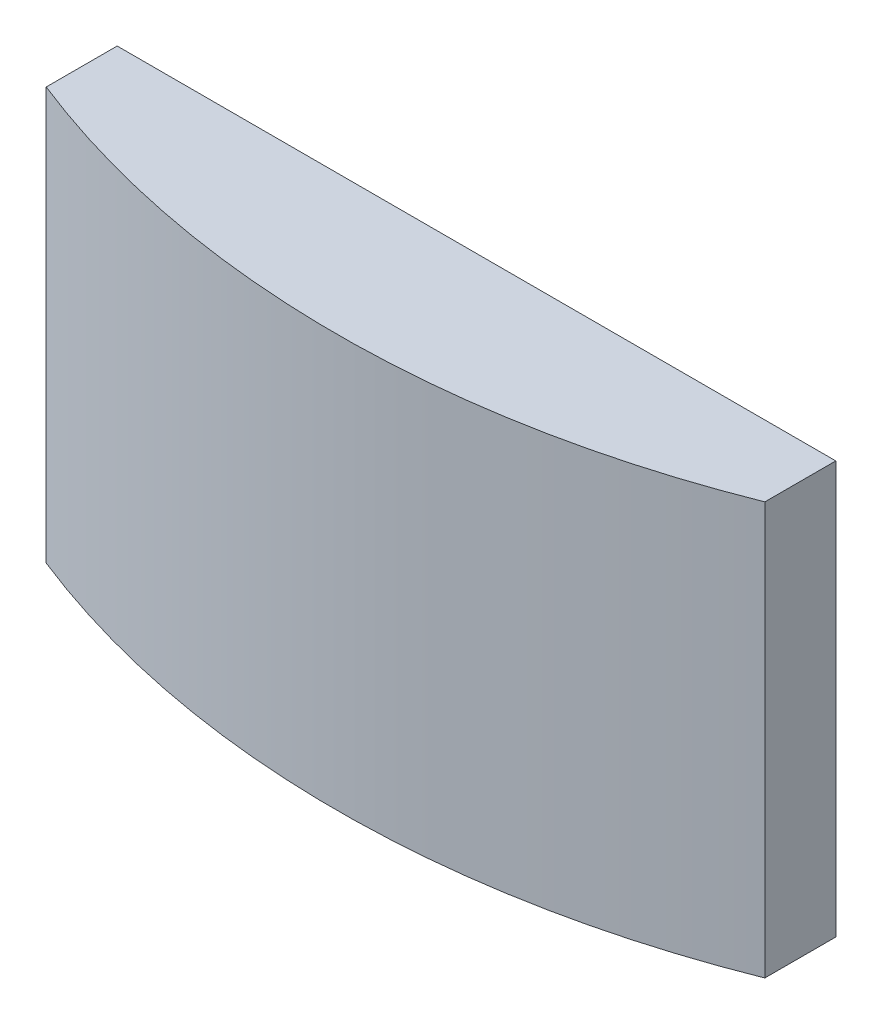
from build123d import *

# Parameters (mm, degrees)
EXTRUDE2_DEPTH = 69.442801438


with BuildPart() as part:
    # Sketch2 → Extrude2 (new body)
    with BuildSketch(Plane(origin=(0, 0, 0), x_dir=(1, 0, 0), z_dir=(0, 1, 0))):
        with BuildLine():
            Line((-59.391176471, 0), (-59.391176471, 11.952941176))
            Line((-59.391176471, 11.952941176), (61.632352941, 11.952941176))
            Line((61.632352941, 11.952941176), (61.632352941, 0))
            ThreePointArc((61.632352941, 0), (1.120588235, -11.583243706), (-59.391176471, 0))
        make_face()
    extrude(amount=EXTRUDE2_DEPTH)


solid = part.part
